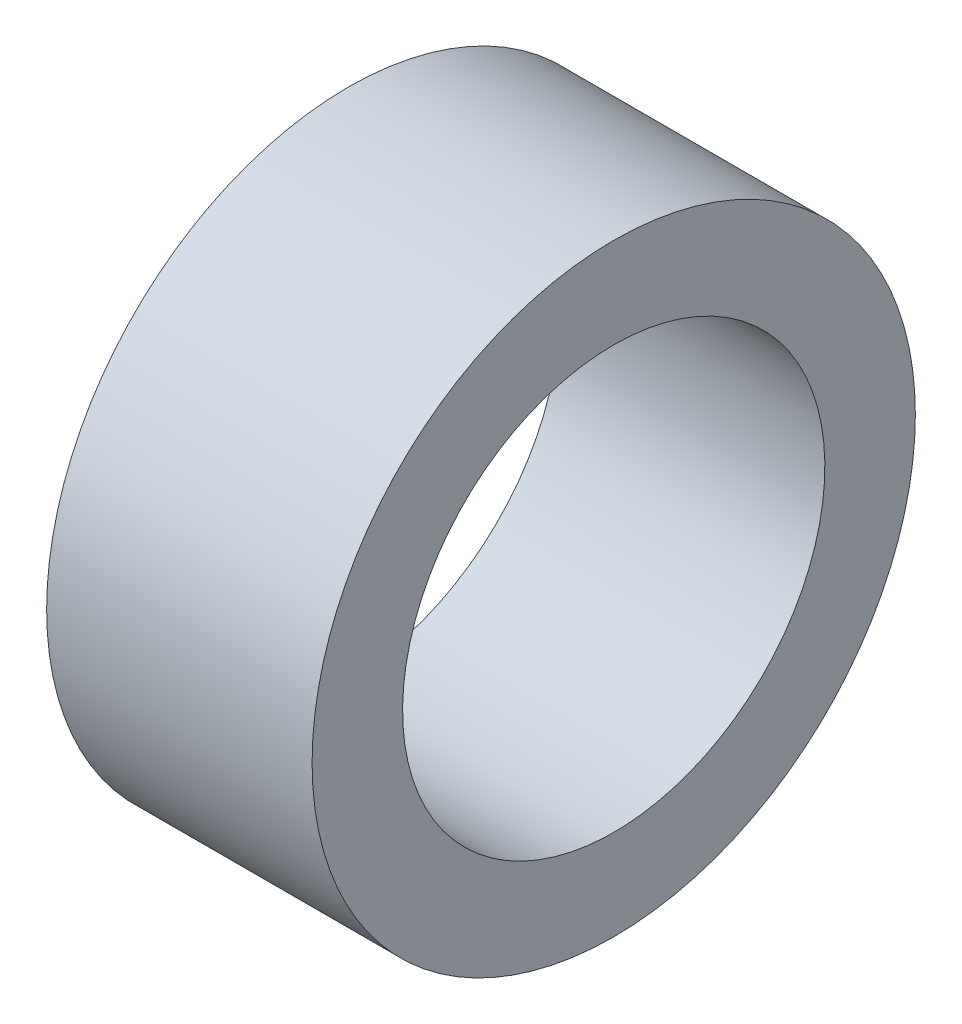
ISO-10303-21;
HEADER;
FILE_DESCRIPTION(('STEP AP214'),'2;1');
FILE_NAME('part.step','',(''),(''),'','','');
FILE_SCHEMA(('AUTOMOTIVE_DESIGN { 1 0 10303 214 1 1 1 1 }'));
ENDSEC;
DATA;
#1=APPLICATION_CONTEXT('core data for automotive mechanical design processes');
#2=APPLICATION_PROTOCOL_DEFINITION('international standard','automotive_design',2000,#1);
#3=PRODUCT_CONTEXT('',#1,'mechanical');
#4=PRODUCT('Part','Part','',(#3));
#5=PRODUCT_RELATED_PRODUCT_CATEGORY('part','',(#4));
#6=PRODUCT_DEFINITION_FORMATION('','',#4);
#7=PRODUCT_DEFINITION_CONTEXT('part definition',#1,'design');
#8=PRODUCT_DEFINITION('design','',#6,#7);
#9=PRODUCT_DEFINITION_SHAPE('','',#8);
#10=(LENGTH_UNIT() NAMED_UNIT(*) SI_UNIT(.MILLI.,.METRE.));
#11=(NAMED_UNIT(*) PLANE_ANGLE_UNIT() SI_UNIT($,.RADIAN.));
#12=(NAMED_UNIT(*) SI_UNIT($,.STERADIAN.) SOLID_ANGLE_UNIT());
#13=UNCERTAINTY_MEASURE_WITH_UNIT(LENGTH_MEASURE(1.E-05),#10,'distance_accuracy_value','');
#14=(GEOMETRIC_REPRESENTATION_CONTEXT(3) GLOBAL_UNCERTAINTY_ASSIGNED_CONTEXT((#13)) GLOBAL_UNIT_ASSIGNED_CONTEXT((#10,
#11,#12)) REPRESENTATION_CONTEXT('',''));
#15=CARTESIAN_POINT('',(0.,0.,0.));
#16=DIRECTION('',(0.,0.,1.));
#17=DIRECTION('',(1.,0.,0.));
#18=AXIS2_PLACEMENT_3D('',#15,#16,#17);
#19=CARTESIAN_POINT('',(11.,0.,0.));
#20=DIRECTION('',(-1.,0.,0.));
#21=DIRECTION('',(0.,0.,1.));
#22=AXIS2_PLACEMENT_3D('',#19,#20,#21);
#23=CYLINDRICAL_SURFACE('',#22,8.75);
#24=CARTESIAN_POINT('',(11.,0.,0.));
#25=DIRECTION('',(-1.,0.,0.));
#26=DIRECTION('',(0.,1.,0.));
#27=AXIS2_PLACEMENT_3D('',#24,#25,#26);
#28=CIRCLE('',#27,8.75);
#29=CARTESIAN_POINT('',(11.,8.75,0.));
#30=VERTEX_POINT('',#29);
#31=EDGE_CURVE('E10',#30,#30,#28,.T.);
#32=ORIENTED_EDGE('',*,*,#31,.F.);
#33=EDGE_LOOP('',(#32));
#34=FACE_BOUND('',#33,.T.);
#35=CARTESIAN_POINT('',(0.,0.,0.));
#36=DIRECTION('',(-1.,0.,0.));
#37=DIRECTION('',(0.,1.,0.));
#38=AXIS2_PLACEMENT_3D('',#35,#36,#37);
#39=CIRCLE('',#38,8.75);
#40=CARTESIAN_POINT('',(0.,8.75,0.));
#41=VERTEX_POINT('',#40);
#42=EDGE_CURVE('E26',#41,#41,#39,.T.);
#43=ORIENTED_EDGE('',*,*,#42,.T.);
#44=EDGE_LOOP('',(#43));
#45=FACE_BOUND('',#44,.T.);
#46=ADVANCED_FACE('F15',(#34,#45),#23,.F.);
#47=CARTESIAN_POINT('',(11.,0.,0.));
#48=DIRECTION('',(-1.,0.,0.));
#49=DIRECTION('',(0.,0.,1.));
#50=AXIS2_PLACEMENT_3D('',#47,#48,#49);
#51=CYLINDRICAL_SURFACE('',#50,12.5);
#52=CARTESIAN_POINT('',(11.,0.,0.));
#53=DIRECTION('',(-1.,0.,0.));
#54=DIRECTION('',(0.,1.,0.));
#55=AXIS2_PLACEMENT_3D('',#52,#53,#54);
#56=CIRCLE('',#55,12.5);
#57=CARTESIAN_POINT('',(11.,12.5,0.));
#58=VERTEX_POINT('',#57);
#59=EDGE_CURVE('E22',#58,#58,#56,.T.);
#60=ORIENTED_EDGE('',*,*,#59,.T.);
#61=EDGE_LOOP('',(#60));
#62=FACE_BOUND('',#61,.T.);
#63=CARTESIAN_POINT('',(0.,0.,0.));
#64=DIRECTION('',(-1.,0.,0.));
#65=DIRECTION('',(0.,1.,0.));
#66=AXIS2_PLACEMENT_3D('',#63,#64,#65);
#67=CIRCLE('',#66,12.5);
#68=CARTESIAN_POINT('',(0.,12.5,0.));
#69=VERTEX_POINT('',#68);
#70=EDGE_CURVE('E31',#69,#69,#67,.T.);
#71=ORIENTED_EDGE('',*,*,#70,.F.);
#72=EDGE_LOOP('',(#71));
#73=FACE_BOUND('',#72,.T.);
#74=ADVANCED_FACE('F17',(#62,#73),#51,.T.);
#75=CARTESIAN_POINT('',(11.,0.,0.));
#76=DIRECTION('',(-1.,0.,0.));
#77=DIRECTION('',(0.,-1.,0.));
#78=AXIS2_PLACEMENT_3D('',#75,#76,#77);
#79=PLANE('',#78);
#80=ORIENTED_EDGE('',*,*,#31,.T.);
#81=EDGE_LOOP('',(#80));
#82=FACE_BOUND('',#81,.T.);
#83=ORIENTED_EDGE('',*,*,#59,.F.);
#84=EDGE_LOOP('',(#83));
#85=FACE_BOUND('',#84,.T.);
#86=ADVANCED_FACE('F43',(#82,#85),#79,.F.);
#87=CARTESIAN_POINT('',(0.,0.,0.));
#88=DIRECTION('',(-1.,0.,0.));
#89=DIRECTION('',(0.,-1.,0.));
#90=AXIS2_PLACEMENT_3D('',#87,#88,#89);
#91=PLANE('',#90);
#92=ORIENTED_EDGE('',*,*,#42,.F.);
#93=EDGE_LOOP('',(#92));
#94=FACE_BOUND('',#93,.T.);
#95=ORIENTED_EDGE('',*,*,#70,.T.);
#96=EDGE_LOOP('',(#95));
#97=FACE_BOUND('',#96,.T.);
#98=ADVANCED_FACE('F40',(#94,#97),#91,.T.);
#99=CLOSED_SHELL('',(#46,#74,#86,#98));
#100=MANIFOLD_SOLID_BREP('B1',#99);
#101=ADVANCED_BREP_SHAPE_REPRESENTATION('',(#18,#100),#14);
#102=SHAPE_DEFINITION_REPRESENTATION(#9,#101);
ENDSEC;
END-ISO-10303-21;
